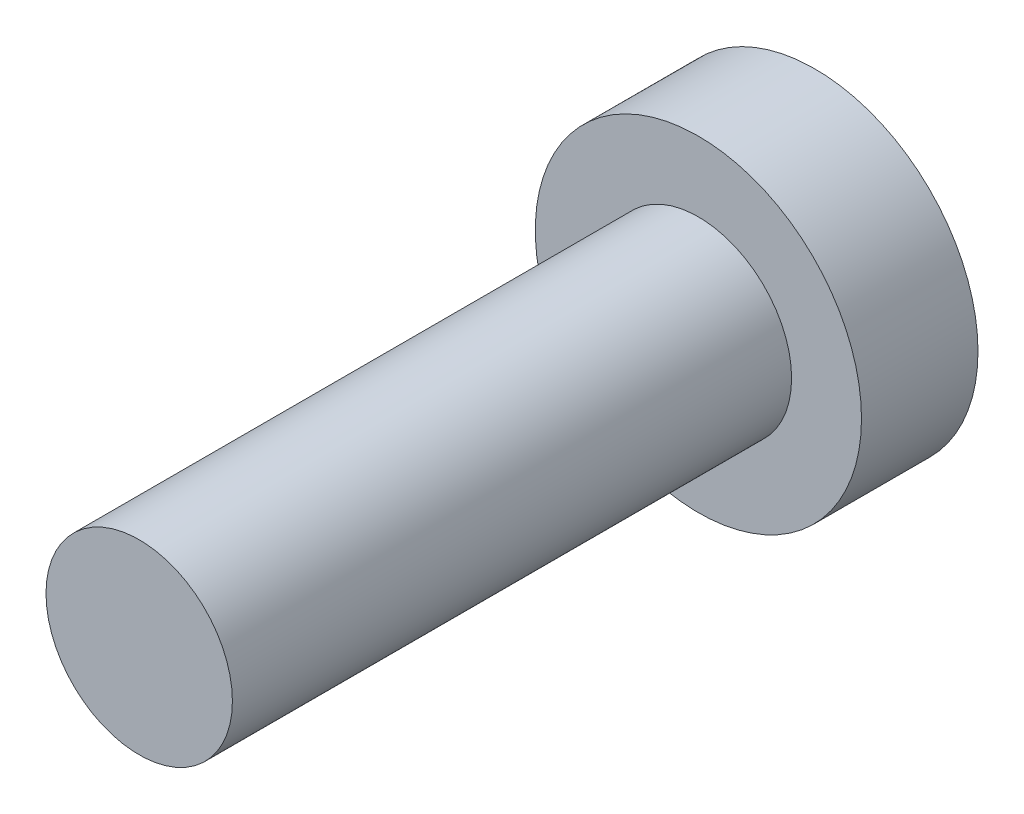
ISO-10303-21;
HEADER;
FILE_DESCRIPTION(('STEP AP214'),'2;1');
FILE_NAME('part.step','',(''),(''),'','','');
FILE_SCHEMA(('AUTOMOTIVE_DESIGN { 1 0 10303 214 1 1 1 1 }'));
ENDSEC;
DATA;
#1=APPLICATION_CONTEXT('core data for automotive mechanical design processes');
#2=APPLICATION_PROTOCOL_DEFINITION('international standard','automotive_design',2000,#1);
#3=PRODUCT_CONTEXT('',#1,'mechanical');
#4=PRODUCT('Part','Part','',(#3));
#5=PRODUCT_RELATED_PRODUCT_CATEGORY('part','',(#4));
#6=PRODUCT_DEFINITION_FORMATION('','',#4);
#7=PRODUCT_DEFINITION_CONTEXT('part definition',#1,'design');
#8=PRODUCT_DEFINITION('design','',#6,#7);
#9=PRODUCT_DEFINITION_SHAPE('','',#8);
#10=(LENGTH_UNIT() NAMED_UNIT(*) SI_UNIT(.MILLI.,.METRE.));
#11=(NAMED_UNIT(*) PLANE_ANGLE_UNIT() SI_UNIT($,.RADIAN.));
#12=(NAMED_UNIT(*) SI_UNIT($,.STERADIAN.) SOLID_ANGLE_UNIT());
#13=UNCERTAINTY_MEASURE_WITH_UNIT(LENGTH_MEASURE(1.E-05),#10,'distance_accuracy_value','');
#14=(GEOMETRIC_REPRESENTATION_CONTEXT(3) GLOBAL_UNCERTAINTY_ASSIGNED_CONTEXT((#13)) GLOBAL_UNIT_ASSIGNED_CONTEXT((#10,
#11,#12)) REPRESENTATION_CONTEXT('',''));
#15=CARTESIAN_POINT('',(0.,0.,0.));
#16=DIRECTION('',(0.,0.,1.));
#17=DIRECTION('',(1.,0.,0.));
#18=AXIS2_PLACEMENT_3D('',#15,#16,#17);
#19=CARTESIAN_POINT('',(-1.11022302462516E-13,0.,11.9999999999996));
#20=DIRECTION('',(0.,0.,-0.999999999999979));
#21=DIRECTION('',(-1.,0.,0.));
#22=AXIS2_PLACEMENT_3D('',#19,#20,#21);
#23=CYLINDRICAL_SURFACE('',#22,2.);
#24=CARTESIAN_POINT('',(-1.11022302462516E-13,0.,11.9999999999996));
#25=DIRECTION('',(0.,0.,0.999999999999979));
#26=DIRECTION('',(1.,0.,0.));
#27=AXIS2_PLACEMENT_3D('',#24,#25,#26);
#28=CIRCLE('',#27,2.);
#29=CARTESIAN_POINT('',(-2.00000000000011,0.,11.9999999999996));
#30=VERTEX_POINT('',#29);
#31=EDGE_CURVE('E10',#30,#30,#28,.T.);
#32=CARTESIAN_POINT('',(0.,0.,0.));
#33=DIRECTION('',(0.,0.,-0.999999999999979));
#34=DIRECTION('',(-1.,0.,0.));
#35=AXIS2_PLACEMENT_3D('',#32,#33,#34);
#36=CIRCLE('',#35,2.);
#37=CARTESIAN_POINT('',(-2.00000000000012,0.,0.));
#38=VERTEX_POINT('',#37);
#39=EDGE_CURVE('E44',#38,#38,#36,.T.);
#40=CARTESIAN_POINT('',(-2.00000000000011,0.,11.9999999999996));
#41=CARTESIAN_POINT('',(-2.00000000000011,0.,11.8749999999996));
#42=CARTESIAN_POINT('',(-2.00000000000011,0.,11.7499999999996));
#43=CARTESIAN_POINT('',(-2.00000000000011,0.,11.4999999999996));
#44=CARTESIAN_POINT('',(-2.00000000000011,0.,11.3749999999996));
#45=CARTESIAN_POINT('',(-2.00000000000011,0.,11.1249999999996));
#46=CARTESIAN_POINT('',(-2.00000000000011,0.,10.9999999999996));
#47=CARTESIAN_POINT('',(-2.00000000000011,0.,10.7499999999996));
#48=CARTESIAN_POINT('',(-2.00000000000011,0.,10.6249999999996));
#49=CARTESIAN_POINT('',(-2.00000000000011,0.,10.3749999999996));
#50=CARTESIAN_POINT('',(-2.00000000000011,0.,10.2499999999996));
#51=CARTESIAN_POINT('',(-2.00000000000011,0.,9.99999999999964));
#52=CARTESIAN_POINT('',(-2.00000000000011,0.,9.87499999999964));
#53=CARTESIAN_POINT('',(-2.00000000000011,0.,9.62499999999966));
#54=CARTESIAN_POINT('',(-2.00000000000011,0.,9.49999999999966));
#55=CARTESIAN_POINT('',(-2.00000000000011,0.,9.24999999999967));
#56=CARTESIAN_POINT('',(-2.00000000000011,0.,9.12499999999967));
#57=CARTESIAN_POINT('',(-2.00000000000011,0.,8.87499999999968));
#58=CARTESIAN_POINT('',(-2.00000000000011,0.,8.74999999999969));
#59=CARTESIAN_POINT('',(-2.00000000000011,0.,8.49999999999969));
#60=CARTESIAN_POINT('',(-2.00000000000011,0.,8.3749999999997));
#61=CARTESIAN_POINT('',(-2.00000000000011,0.,8.12499999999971));
#62=CARTESIAN_POINT('',(-2.00000000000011,0.,7.99999999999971));
#63=CARTESIAN_POINT('',(-2.00000000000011,0.,7.74999999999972));
#64=CARTESIAN_POINT('',(-2.00000000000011,0.,7.62499999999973));
#65=CARTESIAN_POINT('',(-2.00000000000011,0.,7.37499999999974));
#66=CARTESIAN_POINT('',(-2.00000000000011,0.,7.24999999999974));
#67=CARTESIAN_POINT('',(-2.00000000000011,0.,6.99999999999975));
#68=CARTESIAN_POINT('',(-2.00000000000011,0.,6.87499999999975));
#69=CARTESIAN_POINT('',(-2.00000000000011,0.,6.62499999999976));
#70=CARTESIAN_POINT('',(-2.00000000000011,0.,6.49999999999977));
#71=CARTESIAN_POINT('',(-2.00000000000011,0.,6.24999999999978));
#72=CARTESIAN_POINT('',(-2.00000000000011,0.,6.12499999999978));
#73=CARTESIAN_POINT('',(-2.00000000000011,0.,5.87499999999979));
#74=CARTESIAN_POINT('',(-2.00000000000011,0.,5.74999999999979));
#75=CARTESIAN_POINT('',(-2.00000000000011,0.,5.4999999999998));
#76=CARTESIAN_POINT('',(-2.00000000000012,0.,5.37499999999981));
#77=CARTESIAN_POINT('',(-2.00000000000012,0.,5.12499999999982));
#78=CARTESIAN_POINT('',(-2.00000000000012,0.,4.99999999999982));
#79=CARTESIAN_POINT('',(-2.00000000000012,0.,4.74999999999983));
#80=CARTESIAN_POINT('',(-2.00000000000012,0.,4.62499999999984));
#81=CARTESIAN_POINT('',(-2.00000000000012,0.,4.37499999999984));
#82=CARTESIAN_POINT('',(-2.00000000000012,0.,4.24999999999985));
#83=CARTESIAN_POINT('',(-2.00000000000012,0.,3.99999999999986));
#84=CARTESIAN_POINT('',(-2.00000000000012,0.,3.87499999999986));
#85=CARTESIAN_POINT('',(-2.00000000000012,0.,3.62499999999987));
#86=CARTESIAN_POINT('',(-2.00000000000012,0.,3.49999999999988));
#87=CARTESIAN_POINT('',(-2.00000000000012,0.,3.24999999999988));
#88=CARTESIAN_POINT('',(-2.00000000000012,0.,3.12499999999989));
#89=CARTESIAN_POINT('',(-2.00000000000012,0.,2.8749999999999));
#90=CARTESIAN_POINT('',(-2.00000000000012,0.,2.7499999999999));
#91=CARTESIAN_POINT('',(-2.00000000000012,0.,2.49999999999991));
#92=CARTESIAN_POINT('',(-2.00000000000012,0.,2.37499999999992));
#93=CARTESIAN_POINT('',(-2.00000000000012,0.,2.12499999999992));
#94=CARTESIAN_POINT('',(-2.00000000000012,0.,1.99999999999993));
#95=CARTESIAN_POINT('',(-2.00000000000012,0.,1.74999999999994));
#96=CARTESIAN_POINT('',(-2.00000000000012,0.,1.62499999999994));
#97=CARTESIAN_POINT('',(-2.00000000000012,0.,1.37499999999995));
#98=CARTESIAN_POINT('',(-2.00000000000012,0.,1.24999999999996));
#99=CARTESIAN_POINT('',(-2.00000000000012,0.,0.999999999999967));
#100=CARTESIAN_POINT('',(-2.00000000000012,0.,0.874999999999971));
#101=CARTESIAN_POINT('',(-2.00000000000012,0.,0.62499999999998));
#102=CARTESIAN_POINT('',(-2.00000000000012,0.,0.499999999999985));
#103=CARTESIAN_POINT('',(-2.00000000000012,0.,0.249999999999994));
#104=CARTESIAN_POINT('',(-2.00000000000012,0.,0.124999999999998));
#105=CARTESIAN_POINT('',(-2.00000000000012,0.,0.));
#106=B_SPLINE_CURVE_WITH_KNOTS('',3,(#40,#41,#42,#43,#44,#45,#46,#47,#48,#49,#50,#51,#52,#53,
#54,#55,#56,#57,#58,#59,#60,#61,#62,#63,#64,#65,#66,#67,#68,#69,#70,#71,#72,#73,#74,#75,#76,#77,
#78,#79,#80,#81,#82,#83,#84,#85,#86,#87,#88,#89,#90,#91,#92,#93,#94,#95,#96,#97,#98,#99,#100,
#101,#102,#103,#104,#105),.UNSPECIFIED.,.F.,.F.,(4,2,2,2,2,2,2,2,2,2,2,2,2,2,2,2,2,2,2,2,2,2,2,
2,2,2,2,2,2,2,2,2,4),(0.,0.374999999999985,0.749999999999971,1.12499999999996,1.49999999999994,
1.87499999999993,2.24999999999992,2.6249999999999,2.99999999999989,3.37499999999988,
3.74999999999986,4.12499999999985,4.49999999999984,4.87499999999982,5.24999999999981,
5.62499999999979,5.99999999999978,6.37499999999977,6.74999999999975,7.12499999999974,
7.49999999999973,7.87499999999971,8.2499999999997,8.62499999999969,8.99999999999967,
9.37499999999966,9.74999999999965,10.1249999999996,10.4999999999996,10.8749999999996,
11.2499999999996,11.6249999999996,11.9999999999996),.UNSPECIFIED.);
#107=EDGE_CURVE('BSEAM38',#30,#38,#106,.T.);
#108=ORIENTED_EDGE('',*,*,#31,.F.);
#109=ORIENTED_EDGE('',*,*,#39,.F.);
#110=ORIENTED_EDGE('',*,*,#107,.T.);
#111=ORIENTED_EDGE('',*,*,#107,.F.);
#112=EDGE_LOOP('',(#108,#110,#109,#111));
#113=FACE_BOUND('',#112,.T.);
#114=ADVANCED_FACE('F38',(#113),#23,.T.);
#115=CARTESIAN_POINT('',(-1.11022302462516E-13,0.,11.9999999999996));
#116=DIRECTION('',(0.,0.,0.999999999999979));
#117=DIRECTION('',(1.,0.,0.));
#118=AXIS2_PLACEMENT_3D('',#115,#116,#117);
#119=PLANE('',#118);
#120=ORIENTED_EDGE('',*,*,#31,.T.);
#121=EDGE_LOOP('',(#120));
#122=FACE_BOUND('',#121,.T.);
#123=ADVANCED_FACE('F62',(#122),#119,.T.);
#124=CARTESIAN_POINT('',(0.,0.,0.));
#125=DIRECTION('',(0.,0.,-0.999999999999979));
#126=DIRECTION('',(-1.,0.,0.));
#127=AXIS2_PLACEMENT_3D('',#124,#125,#126);
#128=PLANE('',#127);
#129=CARTESIAN_POINT('',(0.,0.,0.));
#130=DIRECTION('',(0.,0.,-0.999999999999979));
#131=DIRECTION('',(-1.,0.,0.));
#132=AXIS2_PLACEMENT_3D('',#129,#130,#131);
#133=CIRCLE('',#132,3.5);
#134=CARTESIAN_POINT('',(3.49999999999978,-6.70017143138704E-13,0.));
#135=VERTEX_POINT('',#134);
#136=EDGE_CURVE('E52',#135,#135,#133,.T.);
#137=ORIENTED_EDGE('',*,*,#136,.F.);
#138=EDGE_LOOP('',(#137));
#139=FACE_BOUND('',#138,.T.);
#140=ORIENTED_EDGE('',*,*,#39,.T.);
#141=EDGE_LOOP('',(#140));
#142=FACE_BOUND('',#141,.T.);
#143=ADVANCED_FACE('F60',(#139,#142),#128,.F.);
#144=CARTESIAN_POINT('',(-2.22044604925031E-13,-6.66133814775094E-13,-2.50000000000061));
#145=DIRECTION('',(0.,0.,0.999999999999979));
#146=DIRECTION('',(1.,0.,0.));
#147=AXIS2_PLACEMENT_3D('',#144,#145,#146);
#148=CYLINDRICAL_SURFACE('',#147,3.5);
#149=CARTESIAN_POINT('',(-2.22044604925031E-13,-6.66133814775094E-13,-2.50000000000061));
#150=DIRECTION('',(0.,0.,-0.999999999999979));
#151=DIRECTION('',(-1.,0.,0.));
#152=AXIS2_PLACEMENT_3D('',#149,#150,#151);
#153=CIRCLE('',#152,3.5);
#154=CARTESIAN_POINT('',(3.49999999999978,-6.69631017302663E-13,-2.50000000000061));
#155=VERTEX_POINT('',#154);
#156=EDGE_CURVE('E48',#155,#155,#153,.T.);
#157=CARTESIAN_POINT('',(3.49999999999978,-6.69631017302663E-13,-2.50000000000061));
#158=CARTESIAN_POINT('',(3.49999999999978,-6.69635039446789E-13,-2.47395833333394));
#159=CARTESIAN_POINT('',(3.49999999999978,-6.69639061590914E-13,-2.44791666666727));
#160=CARTESIAN_POINT('',(3.49999999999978,-6.69647105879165E-13,-2.39583333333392));
#161=CARTESIAN_POINT('',(3.49999999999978,-6.6965112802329E-13,-2.36979166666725));
#162=CARTESIAN_POINT('',(3.49999999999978,-6.69659172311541E-13,-2.3177083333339));
#163=CARTESIAN_POINT('',(3.49999999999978,-6.69663194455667E-13,-2.29166666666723));
#164=CARTESIAN_POINT('',(3.49999999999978,-6.69671238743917E-13,-2.23958333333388));
#165=CARTESIAN_POINT('',(3.49999999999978,-6.69675260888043E-13,-2.21354166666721));
#166=CARTESIAN_POINT('',(3.49999999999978,-6.69683305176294E-13,-2.16145833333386));
#167=CARTESIAN_POINT('',(3.49999999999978,-6.69687327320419E-13,-2.13541666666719));
#168=CARTESIAN_POINT('',(3.49999999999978,-6.6969537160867E-13,-2.08333333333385));
#169=CARTESIAN_POINT('',(3.49999999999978,-6.69699393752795E-13,-2.05729166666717));
#170=CARTESIAN_POINT('',(3.49999999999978,-6.69707438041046E-13,-2.00520833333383));
#171=CARTESIAN_POINT('',(3.49999999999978,-6.69711460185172E-13,-1.97916666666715));
#172=CARTESIAN_POINT('',(3.49999999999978,-6.69719504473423E-13,-1.92708333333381));
#173=CARTESIAN_POINT('',(3.49999999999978,-6.69723526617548E-13,-1.90104166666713));
#174=CARTESIAN_POINT('',(3.49999999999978,-6.69731570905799E-13,-1.84895833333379));
#175=CARTESIAN_POINT('',(3.49999999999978,-6.69735593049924E-13,-1.82291666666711));
#176=CARTESIAN_POINT('',(3.49999999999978,-6.69743637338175E-13,-1.77083333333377));
#177=CARTESIAN_POINT('',(3.49999999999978,-6.69747659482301E-13,-1.7447916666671));
#178=CARTESIAN_POINT('',(3.49999999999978,-6.69755703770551E-13,-1.69270833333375));
#179=CARTESIAN_POINT('',(3.49999999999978,-6.69759725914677E-13,-1.66666666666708));
#180=CARTESIAN_POINT('',(3.49999999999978,-6.69767770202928E-13,-1.61458333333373));
#181=CARTESIAN_POINT('',(3.49999999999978,-6.69771792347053E-13,-1.58854166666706));
#182=CARTESIAN_POINT('',(3.49999999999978,-6.69779836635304E-13,-1.53645833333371));
#183=CARTESIAN_POINT('',(3.49999999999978,-6.6978385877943E-13,-1.51041666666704));
#184=CARTESIAN_POINT('',(3.49999999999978,-6.6979190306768E-13,-1.45833333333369));
#185=CARTESIAN_POINT('',(3.49999999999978,-6.69795925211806E-13,-1.43229166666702));
#186=CARTESIAN_POINT('',(3.49999999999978,-6.69803969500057E-13,-1.38020833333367));
#187=CARTESIAN_POINT('',(3.49999999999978,-6.69807991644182E-13,-1.354166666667));
#188=CARTESIAN_POINT('',(3.49999999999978,-6.69816035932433E-13,-1.30208333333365));
#189=CARTESIAN_POINT('',(3.49999999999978,-6.69820058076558E-13,-1.27604166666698));
#190=CARTESIAN_POINT('',(3.49999999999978,-6.69828102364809E-13,-1.22395833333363));
#191=CARTESIAN_POINT('',(3.49999999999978,-6.69832124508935E-13,-1.19791666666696));
#192=CARTESIAN_POINT('',(3.49999999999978,-6.69840168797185E-13,-1.14583333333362));
#193=CARTESIAN_POINT('',(3.49999999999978,-6.69844190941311E-13,-1.11979166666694));
#194=CARTESIAN_POINT('',(3.49999999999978,-6.69852235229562E-13,-1.0677083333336));
#195=CARTESIAN_POINT('',(3.49999999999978,-6.69856257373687E-13,-1.04166666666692));
#196=CARTESIAN_POINT('',(3.49999999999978,-6.69864301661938E-13,-0.989583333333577));
#197=CARTESIAN_POINT('',(3.49999999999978,-6.69868323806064E-13,-0.963541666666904));
#198=CARTESIAN_POINT('',(3.49999999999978,-6.69876368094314E-13,-0.911458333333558));
#199=CARTESIAN_POINT('',(3.49999999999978,-6.6988039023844E-13,-0.885416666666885));
#200=CARTESIAN_POINT('',(3.49999999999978,-6.69888434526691E-13,-0.833333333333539));
#201=CARTESIAN_POINT('',(3.49999999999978,-6.69892456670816E-13,-0.807291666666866));
#202=CARTESIAN_POINT('',(3.49999999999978,-6.69900500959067E-13,-0.75520833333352));
#203=CARTESIAN_POINT('',(3.49999999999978,-6.69904523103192E-13,-0.729166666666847));
#204=CARTESIAN_POINT('',(3.49999999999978,-6.69912567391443E-13,-0.677083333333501));
#205=CARTESIAN_POINT('',(3.49999999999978,-6.69916589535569E-13,-0.651041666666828));
#206=CARTESIAN_POINT('',(3.49999999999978,-6.69924633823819E-13,-0.598958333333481));
#207=CARTESIAN_POINT('',(3.49999999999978,-6.69928655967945E-13,-0.572916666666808));
#208=CARTESIAN_POINT('',(3.49999999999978,-6.69936700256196E-13,-0.520833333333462));
#209=CARTESIAN_POINT('',(3.49999999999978,-6.69940722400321E-13,-0.494791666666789));
#210=CARTESIAN_POINT('',(3.49999999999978,-6.69948766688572E-13,-0.442708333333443));
#211=CARTESIAN_POINT('',(3.49999999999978,-6.69952788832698E-13,-0.41666666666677));
#212=CARTESIAN_POINT('',(3.49999999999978,-6.69960833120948E-13,-0.364583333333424));
#213=CARTESIAN_POINT('',(3.49999999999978,-6.69964855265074E-13,-0.338541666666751));
#214=CARTESIAN_POINT('',(3.49999999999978,-6.69972899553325E-13,-0.286458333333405));
#215=CARTESIAN_POINT('',(3.49999999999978,-6.6997692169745E-13,-0.260416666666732));
#216=CARTESIAN_POINT('',(3.49999999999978,-6.69984965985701E-13,-0.208333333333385));
#217=CARTESIAN_POINT('',(3.49999999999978,-6.69988988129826E-13,-0.182291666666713));
#218=CARTESIAN_POINT('',(3.49999999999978,-6.69997032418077E-13,-0.130208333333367));
#219=CARTESIAN_POINT('',(3.49999999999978,-6.70001054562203E-13,-0.104166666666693));
#220=CARTESIAN_POINT('',(3.49999999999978,-6.70009098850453E-13,-0.0520833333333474));
#221=CARTESIAN_POINT('',(3.49999999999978,-6.70013120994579E-13,-0.0260416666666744));
#222=CARTESIAN_POINT('',(3.49999999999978,-6.70017143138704E-13,0.));
#223=B_SPLINE_CURVE_WITH_KNOTS('',3,(#157,#158,#159,#160,#161,#162,#163,#164,#165,#166,#167,
#168,#169,#170,#171,#172,#173,#174,#175,#176,#177,#178,#179,#180,#181,#182,#183,#184,#185,#186,
#187,#188,#189,#190,#191,#192,#193,#194,#195,#196,#197,#198,#199,#200,#201,#202,#203,#204,#205,
#206,#207,#208,#209,#210,#211,#212,#213,#214,#215,#216,#217,#218,#219,#220,#221,#222),
.UNSPECIFIED.,.F.,.F.,(4,2,2,2,2,2,2,2,2,2,2,2,2,2,2,2,2,2,2,2,2,2,2,2,2,2,2,2,2,2,2,2,4),(0.,
0.0781250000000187,0.156250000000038,0.234375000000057,0.312500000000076,0.390625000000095,
0.468750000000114,0.546875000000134,0.625000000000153,0.703125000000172,0.781250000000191,
0.85937500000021,0.937500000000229,1.01562500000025,1.09375000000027,1.17187500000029,
1.25000000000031,1.32812500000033,1.40625000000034,1.48437500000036,1.56250000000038,
1.6406250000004,1.71875000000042,1.79687500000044,1.87500000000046,1.95312500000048,
2.0312500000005,2.10937500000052,2.18750000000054,2.26562500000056,2.34375000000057,
2.42187500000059,2.50000000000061),.UNSPECIFIED.);
#224=EDGE_CURVE('BSEAM58',#155,#135,#223,.T.);
#225=ORIENTED_EDGE('',*,*,#156,.F.);
#226=ORIENTED_EDGE('',*,*,#136,.T.);
#227=ORIENTED_EDGE('',*,*,#224,.T.);
#228=ORIENTED_EDGE('',*,*,#224,.F.);
#229=EDGE_LOOP('',(#225,#227,#226,#228));
#230=FACE_BOUND('',#229,.T.);
#231=ADVANCED_FACE('F58',(#230),#148,.T.);
#232=CARTESIAN_POINT('',(-2.22044604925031E-13,-6.66133814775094E-13,-2.50000000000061));
#233=DIRECTION('',(0.,0.,-0.999999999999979));
#234=DIRECTION('',(-1.,0.,0.));
#235=AXIS2_PLACEMENT_3D('',#232,#233,#234);
#236=PLANE('',#235);
#237=ORIENTED_EDGE('',*,*,#156,.T.);
#238=EDGE_LOOP('',(#237));
#239=FACE_BOUND('',#238,.T.);
#240=ADVANCED_FACE('F68',(#239),#236,.T.);
#241=CLOSED_SHELL('',(#114,#123,#143,#231,#240));
#242=MANIFOLD_SOLID_BREP('B2',#241);
#243=ADVANCED_BREP_SHAPE_REPRESENTATION('',(#18,#242),#14);
#244=SHAPE_DEFINITION_REPRESENTATION(#9,#243);
ENDSEC;
END-ISO-10303-21;
